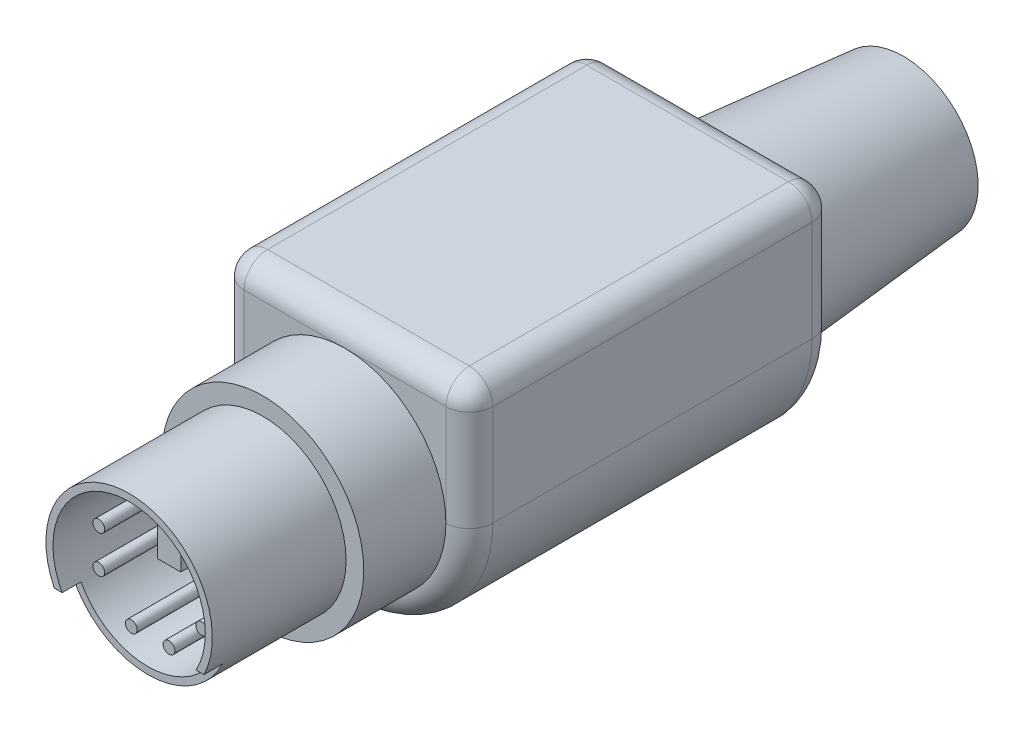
ISO-10303-21;
HEADER;
FILE_DESCRIPTION(('STEP AP214'),'2;1');
FILE_NAME('part.step','',(''),(''),'','','');
FILE_SCHEMA(('AUTOMOTIVE_DESIGN { 1 0 10303 214 1 1 1 1 }'));
ENDSEC;
DATA;
#1=APPLICATION_CONTEXT('core data for automotive mechanical design processes');
#2=APPLICATION_PROTOCOL_DEFINITION('international standard','automotive_design',2000,#1);
#3=PRODUCT_CONTEXT('',#1,'mechanical');
#4=PRODUCT('Part','Part','',(#3));
#5=PRODUCT_RELATED_PRODUCT_CATEGORY('part','',(#4));
#6=PRODUCT_DEFINITION_FORMATION('','',#4);
#7=PRODUCT_DEFINITION_CONTEXT('part definition',#1,'design');
#8=PRODUCT_DEFINITION('design','',#6,#7);
#9=PRODUCT_DEFINITION_SHAPE('','',#8);
#10=(LENGTH_UNIT() NAMED_UNIT(*) SI_UNIT(.MILLI.,.METRE.));
#11=(NAMED_UNIT(*) PLANE_ANGLE_UNIT() SI_UNIT($,.RADIAN.));
#12=(NAMED_UNIT(*) SI_UNIT($,.STERADIAN.) SOLID_ANGLE_UNIT());
#13=UNCERTAINTY_MEASURE_WITH_UNIT(LENGTH_MEASURE(1.E-05),#10,'distance_accuracy_value','');
#14=(GEOMETRIC_REPRESENTATION_CONTEXT(3) GLOBAL_UNCERTAINTY_ASSIGNED_CONTEXT((#13)) GLOBAL_UNIT_ASSIGNED_CONTEXT((#10,
#11,#12)) REPRESENTATION_CONTEXT('',''));
#15=CARTESIAN_POINT('',(0.,0.,0.));
#16=DIRECTION('',(0.,0.,1.));
#17=DIRECTION('',(1.,0.,0.));
#18=AXIS2_PLACEMENT_3D('',#15,#16,#17);
#19=CARTESIAN_POINT('',(0.,0.,0.));
#20=DIRECTION('',(0.,0.,1.));
#21=DIRECTION('',(1.,0.,0.));
#22=AXIS2_PLACEMENT_3D('',#19,#20,#21);
#23=PLANE('',#22);
#24=DIRECTION('',(0.,1.,0.));
#25=VECTOR('',#24,1.);
#26=CARTESIAN_POINT('',(-5.461,6.731,0.));
#27=LINE('',#26,#25);
#28=CARTESIAN_POINT('',(-5.461,0.,0.));
#29=VERTEX_POINT('',#28);
#30=CARTESIAN_POINT('',(-5.461,5.461,0.));
#31=VERTEX_POINT('',#30);
#32=EDGE_CURVE('E336',#29,#31,#27,.T.);
#33=ORIENTED_EDGE('',*,*,#32,.T.);
#34=DIRECTION('',(1.,0.,0.));
#35=VECTOR('',#34,1.);
#36=CARTESIAN_POINT('',(6.731,5.461,0.));
#37=LINE('',#36,#35);
#38=CARTESIAN_POINT('',(5.461,5.461,0.));
#39=VERTEX_POINT('',#38);
#40=EDGE_CURVE('E44',#31,#39,#37,.T.);
#41=ORIENTED_EDGE('',*,*,#40,.T.);
#42=DIRECTION('',(0.,1.,0.));
#43=VECTOR('',#42,1.);
#44=CARTESIAN_POINT('',(5.461,0.,0.));
#45=LINE('',#44,#43);
#46=CARTESIAN_POINT('',(5.461,0.,0.));
#47=VERTEX_POINT('',#46);
#48=EDGE_CURVE('E332',#39,#47,#45,.F.);
#49=ORIENTED_EDGE('',*,*,#48,.T.);
#50=CARTESIAN_POINT('',(0.,0.,0.));
#51=DIRECTION('',(0.,0.,1.));
#52=DIRECTION('',(1.,0.,0.));
#53=AXIS2_PLACEMENT_3D('',#50,#51,#52);
#54=CIRCLE('',#53,5.461);
#55=EDGE_CURVE('E334',#47,#29,#54,.F.);
#56=ORIENTED_EDGE('',*,*,#55,.T.);
#57=EDGE_LOOP('',(#33,#41,#49,#56));
#58=FACE_BOUND('',#57,.T.);
#59=CARTESIAN_POINT('',(0.,0.,0.));
#60=DIRECTION('',(0.,0.,1.));
#61=DIRECTION('',(1.,0.,0.));
#62=AXIS2_PLACEMENT_3D('',#59,#60,#61);
#63=CIRCLE('',#62,4.953);
#64=CARTESIAN_POINT('',(4.953,0.,0.));
#65=VERTEX_POINT('',#64);
#66=EDGE_CURVE('E11',#65,#65,#63,.F.);
#67=ORIENTED_EDGE('',*,*,#66,.F.);
#68=EDGE_LOOP('',(#67));
#69=FACE_BOUND('',#68,.T.);
#70=ADVANCED_FACE('F36',(#58,#69),#23,.F.);
#71=CARTESIAN_POINT('',(0.,0.,24.257));
#72=DIRECTION('',(0.,0.,1.));
#73=DIRECTION('',(1.,0.,0.));
#74=AXIS2_PLACEMENT_3D('',#71,#72,#73);
#75=PLANE('',#74);
#76=CARTESIAN_POINT('',(2.78348565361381,1.01310592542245,24.257));
#77=DIRECTION('',(0.,0.,1.));
#78=DIRECTION('',(1.,0.,0.));
#79=AXIS2_PLACEMENT_3D('',#76,#77,#78);
#80=CIRCLE('',#79,0.3175);
#81=CARTESIAN_POINT('',(3.10098565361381,1.01310592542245,24.257));
#82=VERTEX_POINT('',#81);
#83=EDGE_CURVE('E583',#82,#82,#80,.T.);
#84=ORIENTED_EDGE('',*,*,#83,.F.);
#85=EDGE_LOOP('',(#84));
#86=FACE_BOUND('',#85,.T.);
#87=CARTESIAN_POINT('',(-2.78348565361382,-1.01310592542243,24.257));
#88=DIRECTION('',(0.,0.,1.));
#89=DIRECTION('',(1.,0.,0.));
#90=AXIS2_PLACEMENT_3D('',#87,#88,#89);
#91=CIRCLE('',#90,0.3175);
#92=CARTESIAN_POINT('',(-2.46598565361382,-1.01310592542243,24.257));
#93=VERTEX_POINT('',#92);
#94=EDGE_CURVE('E595',#93,#93,#91,.T.);
#95=ORIENTED_EDGE('',*,*,#94,.F.);
#96=EDGE_LOOP('',(#95));
#97=FACE_BOUND('',#96,.T.);
#98=CARTESIAN_POINT('',(1.01310592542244,-2.78348565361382,24.257));
#99=DIRECTION('',(0.,0.,1.));
#100=DIRECTION('',(1.,0.,0.));
#101=AXIS2_PLACEMENT_3D('',#98,#99,#100);
#102=CIRCLE('',#101,0.3175);
#103=CARTESIAN_POINT('',(1.33060592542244,-2.78348565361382,24.257));
#104=VERTEX_POINT('',#103);
#105=EDGE_CURVE('E607',#104,#104,#102,.T.);
#106=ORIENTED_EDGE('',*,*,#105,.F.);
#107=EDGE_LOOP('',(#106));
#108=FACE_BOUND('',#107,.T.);
#109=CARTESIAN_POINT('',(0.,0.,24.257));
#110=DIRECTION('',(0.,0.,1.));
#111=DIRECTION('',(1.,0.,0.));
#112=AXIS2_PLACEMENT_3D('',#109,#110,#111);
#113=CIRCLE('',#112,4.12196942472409);
#114=CARTESIAN_POINT('',(4.12196942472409,0.,24.257));
#115=VERTEX_POINT('',#114);
#116=EDGE_CURVE('E274',#115,#115,#113,.F.);
#117=ORIENTED_EDGE('',*,*,#116,.F.);
#118=EDGE_LOOP('',(#117));
#119=FACE_BOUND('',#118,.T.);
#120=DIRECTION('',(-1.,0.,0.));
#121=VECTOR('',#120,1.);
#122=CARTESIAN_POINT('',(0.635,0.0579694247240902,24.257));
#123=LINE('',#122,#121);
#124=CARTESIAN_POINT('',(0.635,0.0579694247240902,24.257));
#125=VERTEX_POINT('',#124);
#126=CARTESIAN_POINT('',(-0.635,0.0579694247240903,24.257));
#127=VERTEX_POINT('',#126);
#128=EDGE_CURVE('E51',#125,#127,#123,.T.);
#129=ORIENTED_EDGE('',*,*,#128,.T.);
#130=DIRECTION('',(0.,-1.,0.));
#131=VECTOR('',#130,1.);
#132=CARTESIAN_POINT('',(-0.635,2.59796942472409,24.257));
#133=LINE('',#132,#131);
#134=CARTESIAN_POINT('',(-0.635,2.59796942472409,24.257));
#135=VERTEX_POINT('',#134);
#136=EDGE_CURVE('E161',#135,#127,#133,.T.);
#137=ORIENTED_EDGE('',*,*,#136,.F.);
#138=DIRECTION('',(1.,0.,0.));
#139=VECTOR('',#138,1.);
#140=CARTESIAN_POINT('',(-0.635,2.59796942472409,24.257));
#141=LINE('',#140,#139);
#142=CARTESIAN_POINT('',(0.635,2.59796942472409,24.257));
#143=VERTEX_POINT('',#142);
#144=EDGE_CURVE('E166',#135,#143,#141,.T.);
#145=ORIENTED_EDGE('',*,*,#144,.T.);
#146=DIRECTION('',(0.,1.,0.));
#147=VECTOR('',#146,1.);
#148=CARTESIAN_POINT('',(0.635,0.0579694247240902,24.257));
#149=LINE('',#148,#147);
#150=EDGE_CURVE('E56',#125,#143,#149,.T.);
#151=ORIENTED_EDGE('',*,*,#150,.F.);
#152=EDGE_LOOP('',(#129,#137,#145,#151));
#153=FACE_BOUND('',#152,.T.);
#154=CARTESIAN_POINT('',(-1.02631680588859,-2.81978224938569,24.257));
#155=DIRECTION('',(0.,0.,1.));
#156=DIRECTION('',(1.,0.,0.));
#157=AXIS2_PLACEMENT_3D('',#154,#155,#156);
#158=CIRCLE('',#157,0.3175);
#159=CARTESIAN_POINT('',(-0.708816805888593,-2.81978224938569,24.257));
#160=VERTEX_POINT('',#159);
#161=EDGE_CURVE('E601',#160,#160,#158,.T.);
#162=ORIENTED_EDGE('',*,*,#161,.F.);
#163=EDGE_LOOP('',(#162));
#164=FACE_BOUND('',#163,.T.);
#165=CARTESIAN_POINT('',(2.78348565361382,-1.01310592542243,24.257));
#166=DIRECTION('',(0.,0.,1.));
#167=DIRECTION('',(1.,0.,0.));
#168=AXIS2_PLACEMENT_3D('',#165,#166,#167);
#169=CIRCLE('',#168,0.3175);
#170=CARTESIAN_POINT('',(3.10098565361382,-1.01310592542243,24.257));
#171=VERTEX_POINT('',#170);
#172=EDGE_CURVE('E589',#171,#171,#169,.T.);
#173=ORIENTED_EDGE('',*,*,#172,.F.);
#174=EDGE_LOOP('',(#173));
#175=FACE_BOUND('',#174,.T.);
#176=CARTESIAN_POINT('',(-2.78348565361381,1.01310592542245,24.257));
#177=DIRECTION('',(0.,0.,1.));
#178=DIRECTION('',(1.,0.,0.));
#179=AXIS2_PLACEMENT_3D('',#176,#177,#178);
#180=CIRCLE('',#179,0.3175);
#181=CARTESIAN_POINT('',(-2.46598565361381,1.01310592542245,24.257));
#182=VERTEX_POINT('',#181);
#183=EDGE_CURVE('E575',#182,#182,#180,.T.);
#184=ORIENTED_EDGE('',*,*,#183,.F.);
#185=EDGE_LOOP('',(#184));
#186=FACE_BOUND('',#185,.T.);
#187=ADVANCED_FACE('F163',(#86,#97,#108,#119,#153,#164,#175,#186),#75,.T.);
#188=CARTESIAN_POINT('',(0.,0.,31.496));
#189=DIRECTION('',(0.,0.,-1.));
#190=DIRECTION('',(-1.,0.,0.));
#191=AXIS2_PLACEMENT_3D('',#188,#189,#190);
#192=CYLINDRICAL_SURFACE('',#191,4.50296942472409);
#193=CARTESIAN_POINT('',(0.,0.,24.257));
#194=DIRECTION('',(0.,0.,1.));
#195=DIRECTION('',(1.,0.,0.));
#196=AXIS2_PLACEMENT_3D('',#193,#194,#195);
#197=CIRCLE('',#196,4.50296942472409);
#198=CARTESIAN_POINT('',(4.50296942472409,0.,24.257));
#199=VERTEX_POINT('',#198);
#200=EDGE_CURVE('E277',#199,#199,#197,.T.);
#201=ORIENTED_EDGE('',*,*,#200,.T.);
#202=EDGE_LOOP('',(#201));
#203=FACE_BOUND('',#202,.T.);
#204=DIRECTION('',(0.,0.,1.));
#205=VECTOR('',#204,1.);
#206=CARTESIAN_POINT('',(-4.05258987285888,-1.96296942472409,30.48));
#207=LINE('',#206,#205);
#208=CARTESIAN_POINT('',(-4.05258987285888,-1.96296942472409,30.48));
#209=VERTEX_POINT('',#208);
#210=CARTESIAN_POINT('',(-4.05258987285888,-1.96296942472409,31.496));
#211=VERTEX_POINT('',#210);
#212=EDGE_CURVE('E217',#209,#211,#207,.T.);
#213=ORIENTED_EDGE('',*,*,#212,.T.);
#214=CARTESIAN_POINT('',(0.,0.,31.496));
#215=DIRECTION('',(0.,0.,1.));
#216=DIRECTION('',(1.,0.,0.));
#217=AXIS2_PLACEMENT_3D('',#214,#215,#216);
#218=CIRCLE('',#217,4.50296942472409);
#219=CARTESIAN_POINT('',(4.05258987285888,-1.96296942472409,31.496));
#220=VERTEX_POINT('',#219);
#221=EDGE_CURVE('E280',#220,#211,#218,.T.);
#222=ORIENTED_EDGE('',*,*,#221,.F.);
#223=DIRECTION('',(0.,0.,1.));
#224=VECTOR('',#223,1.);
#225=CARTESIAN_POINT('',(4.05258987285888,-1.96296942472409,30.48));
#226=LINE('',#225,#224);
#227=CARTESIAN_POINT('',(4.05258987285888,-1.96296942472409,30.48));
#228=VERTEX_POINT('',#227);
#229=EDGE_CURVE('E216',#228,#220,#226,.T.);
#230=ORIENTED_EDGE('',*,*,#229,.F.);
#231=CARTESIAN_POINT('',(0.,0.,30.48));
#232=DIRECTION('',(0.,0.,1.));
#233=DIRECTION('',(1.,0.,0.));
#234=AXIS2_PLACEMENT_3D('',#231,#232,#233);
#235=CIRCLE('',#234,4.50296942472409);
#236=EDGE_CURVE('E206',#209,#228,#235,.T.);
#237=ORIENTED_EDGE('',*,*,#236,.F.);
#238=EDGE_LOOP('',(#213,#222,#230,#237));
#239=FACE_BOUND('',#238,.T.);
#240=ADVANCED_FACE('F421',(#203,#239),#192,.T.);
#241=CARTESIAN_POINT('',(0.,0.,31.496));
#242=DIRECTION('',(0.,0.,1.));
#243=DIRECTION('',(1.,0.,0.));
#244=AXIS2_PLACEMENT_3D('',#241,#242,#243);
#245=PLANE('',#244);
#246=ORIENTED_EDGE('',*,*,#221,.T.);
#247=DIRECTION('',(1.,0.,0.));
#248=VECTOR('',#247,1.);
#249=CARTESIAN_POINT('',(-4.05258987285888,-1.96296942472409,31.496));
#250=LINE('',#249,#248);
#251=CARTESIAN_POINT('',(-3.62455279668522,-1.96296942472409,31.496));
#252=VERTEX_POINT('',#251);
#253=EDGE_CURVE('E203',#211,#252,#250,.T.);
#254=ORIENTED_EDGE('',*,*,#253,.T.);
#255=CARTESIAN_POINT('',(0.,0.,31.496));
#256=DIRECTION('',(0.,0.,1.));
#257=DIRECTION('',(1.,0.,0.));
#258=AXIS2_PLACEMENT_3D('',#255,#256,#257);
#259=CIRCLE('',#258,4.12196942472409);
#260=CARTESIAN_POINT('',(3.62455279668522,-1.96296942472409,31.496));
#261=VERTEX_POINT('',#260);
#262=EDGE_CURVE('E271',#261,#252,#259,.T.);
#263=ORIENTED_EDGE('',*,*,#262,.F.);
#264=DIRECTION('',(1.,0.,0.));
#265=VECTOR('',#264,1.);
#266=CARTESIAN_POINT('',(3.62455279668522,-1.96296942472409,31.496));
#267=LINE('',#266,#265);
#268=EDGE_CURVE('E200',#261,#220,#267,.T.);
#269=ORIENTED_EDGE('',*,*,#268,.T.);
#270=EDGE_LOOP('',(#246,#254,#263,#269));
#271=FACE_BOUND('',#270,.T.);
#272=ADVANCED_FACE('F461',(#271),#245,.T.);
#273=CARTESIAN_POINT('',(0.,0.,12.5983098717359));
#274=DIRECTION('',(0.,0.,1.));
#275=DIRECTION('',(1.,0.,0.));
#276=AXIS2_PLACEMENT_3D('',#273,#274,#275);
#277=CYLINDRICAL_SURFACE('',#276,4.12196942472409);
#278=ORIENTED_EDGE('',*,*,#116,.T.);
#279=EDGE_LOOP('',(#278));
#280=FACE_BOUND('',#279,.T.);
#281=DIRECTION('',(0.,0.,1.));
#282=VECTOR('',#281,1.);
#283=CARTESIAN_POINT('',(-3.62455279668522,-1.96296942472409,30.48));
#284=LINE('',#283,#282);
#285=CARTESIAN_POINT('',(-3.62455279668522,-1.96296942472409,30.48));
#286=VERTEX_POINT('',#285);
#287=EDGE_CURVE('E221',#286,#252,#284,.T.);
#288=ORIENTED_EDGE('',*,*,#287,.F.);
#289=CARTESIAN_POINT('',(0.,0.,30.48));
#290=DIRECTION('',(0.,0.,1.));
#291=DIRECTION('',(1.,0.,0.));
#292=AXIS2_PLACEMENT_3D('',#289,#290,#291);
#293=CIRCLE('',#292,4.12196942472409);
#294=CARTESIAN_POINT('',(3.62455279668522,-1.96296942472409,30.48));
#295=VERTEX_POINT('',#294);
#296=EDGE_CURVE('E211',#286,#295,#293,.T.);
#297=ORIENTED_EDGE('',*,*,#296,.T.);
#298=DIRECTION('',(0.,0.,1.));
#299=VECTOR('',#298,1.);
#300=CARTESIAN_POINT('',(3.62455279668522,-1.96296942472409,30.48));
#301=LINE('',#300,#299);
#302=EDGE_CURVE('E223',#295,#261,#301,.T.);
#303=ORIENTED_EDGE('',*,*,#302,.T.);
#304=ORIENTED_EDGE('',*,*,#262,.T.);
#305=EDGE_LOOP('',(#288,#297,#303,#304));
#306=FACE_BOUND('',#305,.T.);
#307=ADVANCED_FACE('F455',(#280,#306),#277,.F.);
#308=CARTESIAN_POINT('',(0.,0.,19.812));
#309=DIRECTION('',(0.,0.,1.));
#310=DIRECTION('',(1.,0.,0.));
#311=AXIS2_PLACEMENT_3D('',#308,#309,#310);
#312=PLANE('',#311);
#313=CARTESIAN_POINT('',(0.,0.,19.812));
#314=DIRECTION('',(0.,0.,1.));
#315=DIRECTION('',(1.,0.,0.));
#316=AXIS2_PLACEMENT_3D('',#313,#314,#315);
#317=CIRCLE('',#316,5.461);
#318=CARTESIAN_POINT('',(5.461,0.,19.812));
#319=VERTEX_POINT('',#318);
#320=CARTESIAN_POINT('',(0.,5.461,19.812));
#321=VERTEX_POINT('',#320);
#322=EDGE_CURVE('E284',#319,#321,#317,.T.);
#323=ORIENTED_EDGE('',*,*,#322,.F.);
#324=DIRECTION('',(0.,1.,0.));
#325=VECTOR('',#324,1.);
#326=CARTESIAN_POINT('',(5.461,6.731,19.812));
#327=LINE('',#326,#325);
#328=CARTESIAN_POINT('',(5.461,5.461,19.812));
#329=VERTEX_POINT('',#328);
#330=EDGE_CURVE('E313',#319,#329,#327,.T.);
#331=ORIENTED_EDGE('',*,*,#330,.T.);
#332=DIRECTION('',(1.,0.,0.));
#333=VECTOR('',#332,1.);
#334=CARTESIAN_POINT('',(0.,5.461,19.812));
#335=LINE('',#334,#333);
#336=EDGE_CURVE('E310',#329,#321,#335,.F.);
#337=ORIENTED_EDGE('',*,*,#336,.T.);
#338=EDGE_LOOP('',(#323,#331,#337));
#339=FACE_BOUND('',#338,.T.);
#340=ADVANCED_FACE('F433',(#339),#312,.T.);
#341=CARTESIAN_POINT('',(0.,0.,24.257));
#342=DIRECTION('',(0.,0.,1.));
#343=DIRECTION('',(1.,0.,0.));
#344=AXIS2_PLACEMENT_3D('',#341,#342,#343);
#345=PLANE('',#344);
#346=CARTESIAN_POINT('',(0.,0.,24.257));
#347=DIRECTION('',(0.,0.,1.));
#348=DIRECTION('',(1.,0.,0.));
#349=AXIS2_PLACEMENT_3D('',#346,#347,#348);
#350=CIRCLE('',#349,5.461);
#351=CARTESIAN_POINT('',(5.461,0.,24.257));
#352=VERTEX_POINT('',#351);
#353=EDGE_CURVE('E287',#352,#352,#350,.T.);
#354=ORIENTED_EDGE('',*,*,#353,.T.);
#355=EDGE_LOOP('',(#354));
#356=FACE_BOUND('',#355,.T.);
#357=ORIENTED_EDGE('',*,*,#200,.F.);
#358=EDGE_LOOP('',(#357));
#359=FACE_BOUND('',#358,.T.);
#360=ADVANCED_FACE('F431',(#356,#359),#345,.T.);
#361=CARTESIAN_POINT('',(-5.461,0.,19.812));
#362=VERTEX_POINT('',#361);
#363=EDGE_CURVE('E288',#321,#362,#317,.T.);
#364=ORIENTED_EDGE('',*,*,#363,.F.);
#365=DIRECTION('',(1.,0.,0.));
#366=VECTOR('',#365,1.);
#367=CARTESIAN_POINT('',(0.,5.461,19.812));
#368=LINE('',#367,#366);
#369=CARTESIAN_POINT('',(-5.461,5.461,19.812));
#370=VERTEX_POINT('',#369);
#371=EDGE_CURVE('E308',#321,#370,#368,.F.);
#372=ORIENTED_EDGE('',*,*,#371,.T.);
#373=DIRECTION('',(0.,1.,0.));
#374=VECTOR('',#373,1.);
#375=CARTESIAN_POINT('',(-5.461,0.,19.812));
#376=LINE('',#375,#374);
#377=EDGE_CURVE('E306',#370,#362,#376,.F.);
#378=ORIENTED_EDGE('',*,*,#377,.T.);
#379=EDGE_LOOP('',(#364,#372,#378));
#380=FACE_BOUND('',#379,.T.);
#381=ADVANCED_FACE('F428',(#380),#312,.T.);
#382=CARTESIAN_POINT('',(-6.731,6.731,19.812));
#383=DIRECTION('',(0.,1.,0.));
#384=DIRECTION('',(-1.,0.,0.));
#385=AXIS2_PLACEMENT_3D('',#382,#383,#384);
#386=PLANE('',#385);
#387=DIRECTION('',(0.,0.,-1.));
#388=VECTOR('',#387,1.);
#389=CARTESIAN_POINT('',(-5.461,6.731,19.812));
#390=LINE('',#389,#388);
#391=CARTESIAN_POINT('',(-5.461,6.731,1.27));
#392=VERTEX_POINT('',#391);
#393=CARTESIAN_POINT('',(-5.461,6.731,18.542));
#394=VERTEX_POINT('',#393);
#395=EDGE_CURVE('E299',#392,#394,#390,.F.);
#396=ORIENTED_EDGE('',*,*,#395,.T.);
#397=DIRECTION('',(1.,0.,0.));
#398=VECTOR('',#397,1.);
#399=CARTESIAN_POINT('',(-6.731,6.731,18.542));
#400=LINE('',#399,#398);
#401=CARTESIAN_POINT('',(5.461,6.731,18.542));
#402=VERTEX_POINT('',#401);
#403=EDGE_CURVE('E303',#394,#402,#400,.T.);
#404=ORIENTED_EDGE('',*,*,#403,.T.);
#405=DIRECTION('',(0.,0.,-1.));
#406=VECTOR('',#405,1.);
#407=CARTESIAN_POINT('',(5.461,6.731,0.));
#408=LINE('',#407,#406);
#409=CARTESIAN_POINT('',(5.461,6.731,1.27));
#410=VERTEX_POINT('',#409);
#411=EDGE_CURVE('E301',#402,#410,#408,.T.);
#412=ORIENTED_EDGE('',*,*,#411,.T.);
#413=DIRECTION('',(1.,0.,0.));
#414=VECTOR('',#413,1.);
#415=CARTESIAN_POINT('',(-6.731,6.731,1.27));
#416=LINE('',#415,#414);
#417=EDGE_CURVE('E295',#410,#392,#416,.F.);
#418=ORIENTED_EDGE('',*,*,#417,.T.);
#419=EDGE_LOOP('',(#396,#404,#412,#418));
#420=FACE_BOUND('',#419,.T.);
#421=ADVANCED_FACE('F38',(#420),#386,.T.);
#422=CARTESIAN_POINT('',(-6.731,0.,19.812));
#423=DIRECTION('',(-1.,0.,0.));
#424=DIRECTION('',(0.,0.,1.));
#425=AXIS2_PLACEMENT_3D('',#422,#423,#424);
#426=PLANE('',#425);
#427=DIRECTION('',(0.,0.,-1.));
#428=VECTOR('',#427,1.);
#429=CARTESIAN_POINT('',(-6.731,0.,19.812));
#430=LINE('',#429,#428);
#431=CARTESIAN_POINT('',(-6.731,0.,18.542));
#432=VERTEX_POINT('',#431);
#433=CARTESIAN_POINT('',(-6.731,0.,1.27));
#434=VERTEX_POINT('',#433);
#435=EDGE_CURVE('E292',#432,#434,#430,.T.);
#436=ORIENTED_EDGE('',*,*,#435,.F.);
#437=DIRECTION('',(0.,1.,0.));
#438=VECTOR('',#437,1.);
#439=CARTESIAN_POINT('',(-6.731,0.,18.542));
#440=LINE('',#439,#438);
#441=CARTESIAN_POINT('',(-6.731,5.461,18.542));
#442=VERTEX_POINT('',#441);
#443=EDGE_CURVE('E326',#432,#442,#440,.T.);
#444=ORIENTED_EDGE('',*,*,#443,.T.);
#445=DIRECTION('',(0.,0.,-1.));
#446=VECTOR('',#445,1.);
#447=CARTESIAN_POINT('',(-6.731,5.461,19.812));
#448=LINE('',#447,#446);
#449=CARTESIAN_POINT('',(-6.731,5.461,1.27));
#450=VERTEX_POINT('',#449);
#451=EDGE_CURVE('E324',#442,#450,#448,.T.);
#452=ORIENTED_EDGE('',*,*,#451,.T.);
#453=DIRECTION('',(0.,1.,0.));
#454=VECTOR('',#453,1.);
#455=CARTESIAN_POINT('',(-6.731,0.,1.27));
#456=LINE('',#455,#454);
#457=EDGE_CURVE('E322',#450,#434,#456,.F.);
#458=ORIENTED_EDGE('',*,*,#457,.T.);
#459=EDGE_LOOP('',(#436,#444,#452,#458));
#460=FACE_BOUND('',#459,.T.);
#461=ADVANCED_FACE('F395',(#460),#426,.T.);
#462=CARTESIAN_POINT('',(0.,0.,19.812));
#463=DIRECTION('',(0.,0.,-1.));
#464=DIRECTION('',(-1.,0.,0.));
#465=AXIS2_PLACEMENT_3D('',#462,#463,#464);
#466=CYLINDRICAL_SURFACE('',#465,6.731);
#467=DIRECTION('',(0.,0.,-1.));
#468=VECTOR('',#467,1.);
#469=CARTESIAN_POINT('',(6.731,0.,19.812));
#470=LINE('',#469,#468);
#471=CARTESIAN_POINT('',(6.731,0.,18.542));
#472=VERTEX_POINT('',#471);
#473=CARTESIAN_POINT('',(6.731,0.,1.27));
#474=VERTEX_POINT('',#473);
#475=EDGE_CURVE('E291',#472,#474,#470,.T.);
#476=ORIENTED_EDGE('',*,*,#475,.F.);
#477=CARTESIAN_POINT('',(0.,0.,18.542));
#478=DIRECTION('',(0.,0.,1.));
#479=DIRECTION('',(1.,0.,0.));
#480=AXIS2_PLACEMENT_3D('',#477,#478,#479);
#481=CIRCLE('',#480,6.731);
#482=EDGE_CURVE('E330',#472,#432,#481,.F.);
#483=ORIENTED_EDGE('',*,*,#482,.T.);
#484=ORIENTED_EDGE('',*,*,#435,.T.);
#485=CARTESIAN_POINT('',(0.,0.,1.27));
#486=DIRECTION('',(0.,0.,1.));
#487=DIRECTION('',(1.,0.,0.));
#488=AXIS2_PLACEMENT_3D('',#485,#486,#487);
#489=CIRCLE('',#488,6.731);
#490=EDGE_CURVE('E328',#434,#474,#489,.T.);
#491=ORIENTED_EDGE('',*,*,#490,.T.);
#492=EDGE_LOOP('',(#476,#483,#484,#491));
#493=FACE_BOUND('',#492,.T.);
#494=ADVANCED_FACE('F392',(#493),#466,.T.);
#495=CARTESIAN_POINT('',(6.731,0.,19.812));
#496=DIRECTION('',(-1.,0.,0.));
#497=DIRECTION('',(0.,-1.,0.));
#498=AXIS2_PLACEMENT_3D('',#495,#496,#497);
#499=PLANE('',#498);
#500=DIRECTION('',(0.,0.,-1.));
#501=VECTOR('',#500,1.);
#502=CARTESIAN_POINT('',(6.731,5.461,19.812));
#503=LINE('',#502,#501);
#504=CARTESIAN_POINT('',(6.731,5.461,1.27));
#505=VERTEX_POINT('',#504);
#506=CARTESIAN_POINT('',(6.731,5.461,18.542));
#507=VERTEX_POINT('',#506);
#508=EDGE_CURVE('E317',#505,#507,#503,.F.);
#509=ORIENTED_EDGE('',*,*,#508,.T.);
#510=DIRECTION('',(0.,1.,0.));
#511=VECTOR('',#510,1.);
#512=CARTESIAN_POINT('',(6.731,0.,18.542));
#513=LINE('',#512,#511);
#514=EDGE_CURVE('E319',#507,#472,#513,.F.);
#515=ORIENTED_EDGE('',*,*,#514,.T.);
#516=ORIENTED_EDGE('',*,*,#475,.T.);
#517=DIRECTION('',(0.,1.,0.));
#518=VECTOR('',#517,1.);
#519=CARTESIAN_POINT('',(6.731,0.,1.27));
#520=LINE('',#519,#518);
#521=EDGE_CURVE('E315',#474,#505,#520,.T.);
#522=ORIENTED_EDGE('',*,*,#521,.T.);
#523=EDGE_LOOP('',(#509,#515,#516,#522));
#524=FACE_BOUND('',#523,.T.);
#525=ADVANCED_FACE('F375',(#524),#499,.F.);
#526=CARTESIAN_POINT('',(0.,0.,24.257));
#527=DIRECTION('',(0.,0.,-1.));
#528=DIRECTION('',(-1.,0.,0.));
#529=AXIS2_PLACEMENT_3D('',#526,#527,#528);
#530=CYLINDRICAL_SURFACE('',#529,5.461);
#531=ORIENTED_EDGE('',*,*,#353,.F.);
#532=EDGE_LOOP('',(#531));
#533=FACE_BOUND('',#532,.T.);
#534=ORIENTED_EDGE('',*,*,#322,.T.);
#535=ORIENTED_EDGE('',*,*,#363,.T.);
#536=EDGE_CURVE('E283',#362,#319,#317,.T.);
#537=ORIENTED_EDGE('',*,*,#536,.T.);
#538=EDGE_LOOP('',(#534,#535,#537));
#539=FACE_BOUND('',#538,.T.);
#540=ADVANCED_FACE('F426',(#533,#539),#530,.T.);
#541=CARTESIAN_POINT('',(0.,0.,1.27));
#542=DIRECTION('',(0.,0.,1.));
#543=DIRECTION('',(1.,0.,0.));
#544=AXIS2_PLACEMENT_3D('',#541,#542,#543);
#545=TOROIDAL_SURFACE('',#544,5.461,1.27);
#546=CARTESIAN_POINT('',(5.461,0.,1.27));
#547=DIRECTION('',(0.,1.,0.));
#548=DIRECTION('',(0.,0.,1.));
#549=AXIS2_PLACEMENT_3D('',#546,#547,#548);
#550=CIRCLE('',#549,1.27);
#551=EDGE_CURVE('E265',#474,#47,#550,.T.);
#552=ORIENTED_EDGE('',*,*,#551,.F.);
#553=ORIENTED_EDGE('',*,*,#490,.F.);
#554=CARTESIAN_POINT('',(-5.461,0.,1.27));
#555=DIRECTION('',(0.,1.,0.));
#556=DIRECTION('',(0.,0.,1.));
#557=AXIS2_PLACEMENT_3D('',#554,#555,#556);
#558=CIRCLE('',#557,1.27);
#559=EDGE_CURVE('E268',#29,#434,#558,.T.);
#560=ORIENTED_EDGE('',*,*,#559,.F.);
#561=ORIENTED_EDGE('',*,*,#55,.F.);
#562=EDGE_LOOP('',(#552,#553,#560,#561));
#563=FACE_BOUND('',#562,.T.);
#564=ADVANCED_FACE('F441',(#563),#545,.T.);
#565=CARTESIAN_POINT('',(-5.461,0.,1.27));
#566=DIRECTION('',(0.,-1.,0.));
#567=DIRECTION('',(0.,0.,-1.));
#568=AXIS2_PLACEMENT_3D('',#565,#566,#567);
#569=CYLINDRICAL_SURFACE('',#568,1.27);
#570=ORIENTED_EDGE('',*,*,#559,.T.);
#571=ORIENTED_EDGE('',*,*,#457,.F.);
#572=CARTESIAN_POINT('',(-5.461,5.461,1.27));
#573=DIRECTION('',(0.,1.,0.));
#574=DIRECTION('',(0.,0.,1.));
#575=AXIS2_PLACEMENT_3D('',#572,#573,#574);
#576=CIRCLE('',#575,1.27);
#577=EDGE_CURVE('E262',#31,#450,#576,.T.);
#578=ORIENTED_EDGE('',*,*,#577,.F.);
#579=ORIENTED_EDGE('',*,*,#32,.F.);
#580=EDGE_LOOP('',(#570,#571,#578,#579));
#581=FACE_BOUND('',#580,.T.);
#582=ADVANCED_FACE('F353',(#581),#569,.T.);
#583=CARTESIAN_POINT('',(0.,5.461,1.27));
#584=DIRECTION('',(-1.,0.,0.));
#585=DIRECTION('',(0.,-1.,0.));
#586=AXIS2_PLACEMENT_3D('',#583,#584,#585);
#587=CYLINDRICAL_SURFACE('',#586,1.27);
#588=CARTESIAN_POINT('',(5.461,5.461,1.27));
#589=DIRECTION('',(1.,0.,0.));
#590=DIRECTION('',(0.,0.,-1.));
#591=AXIS2_PLACEMENT_3D('',#588,#589,#590);
#592=CIRCLE('',#591,1.27);
#593=EDGE_CURVE('E256',#39,#410,#592,.T.);
#594=ORIENTED_EDGE('',*,*,#593,.F.);
#595=ORIENTED_EDGE('',*,*,#40,.F.);
#596=CARTESIAN_POINT('',(-5.461,5.461,1.27));
#597=DIRECTION('',(-1.,0.,0.));
#598=DIRECTION('',(0.,0.,1.));
#599=AXIS2_PLACEMENT_3D('',#596,#597,#598);
#600=CIRCLE('',#599,1.27);
#601=EDGE_CURVE('E259',#392,#31,#600,.T.);
#602=ORIENTED_EDGE('',*,*,#601,.F.);
#603=ORIENTED_EDGE('',*,*,#417,.F.);
#604=EDGE_LOOP('',(#594,#595,#602,#603));
#605=FACE_BOUND('',#604,.T.);
#606=ADVANCED_FACE('F348',(#605),#587,.T.);
#607=CARTESIAN_POINT('',(5.461,0.,1.27));
#608=DIRECTION('',(0.,1.,0.));
#609=DIRECTION('',(-1.,0.,0.));
#610=AXIS2_PLACEMENT_3D('',#607,#608,#609);
#611=CYLINDRICAL_SURFACE('',#610,1.27);
#612=ORIENTED_EDGE('',*,*,#551,.T.);
#613=ORIENTED_EDGE('',*,*,#48,.F.);
#614=CARTESIAN_POINT('',(5.461,5.461,1.27));
#615=DIRECTION('',(0.,1.,0.));
#616=DIRECTION('',(0.,0.,1.));
#617=AXIS2_PLACEMENT_3D('',#614,#615,#616);
#618=CIRCLE('',#617,1.27);
#619=EDGE_CURVE('E254',#505,#39,#618,.T.);
#620=ORIENTED_EDGE('',*,*,#619,.F.);
#621=ORIENTED_EDGE('',*,*,#521,.F.);
#622=EDGE_LOOP('',(#612,#613,#620,#621));
#623=FACE_BOUND('',#622,.T.);
#624=ADVANCED_FACE('F739',(#623),#611,.T.);
#625=CARTESIAN_POINT('',(-5.461,5.461,1.27));
#626=DIRECTION('',(0.,0.,1.));
#627=DIRECTION('',(1.,0.,0.));
#628=AXIS2_PLACEMENT_3D('',#625,#626,#627);
#629=SPHERICAL_SURFACE('',#628,1.27);
#630=ORIENTED_EDGE('',*,*,#601,.T.);
#631=ORIENTED_EDGE('',*,*,#577,.T.);
#632=CARTESIAN_POINT('',(-5.461,5.461,1.27));
#633=DIRECTION('',(0.,0.,-1.));
#634=DIRECTION('',(-1.,0.,0.));
#635=AXIS2_PLACEMENT_3D('',#632,#633,#634);
#636=CIRCLE('',#635,1.27);
#637=EDGE_CURVE('E248',#392,#450,#636,.F.);
#638=ORIENTED_EDGE('',*,*,#637,.F.);
#639=EDGE_LOOP('',(#630,#631,#638));
#640=FACE_BOUND('',#639,.T.);
#641=ADVANCED_FACE('F355',(#640),#629,.T.);
#642=CARTESIAN_POINT('',(5.461,5.461,1.27));
#643=DIRECTION('',(0.,0.,1.));
#644=DIRECTION('',(1.,0.,0.));
#645=AXIS2_PLACEMENT_3D('',#642,#643,#644);
#646=SPHERICAL_SURFACE('',#645,1.27);
#647=ORIENTED_EDGE('',*,*,#619,.T.);
#648=ORIENTED_EDGE('',*,*,#593,.T.);
#649=CARTESIAN_POINT('',(5.461,5.461,1.27));
#650=DIRECTION('',(0.,0.,-1.));
#651=DIRECTION('',(-1.,0.,0.));
#652=AXIS2_PLACEMENT_3D('',#649,#650,#651);
#653=CIRCLE('',#652,1.27);
#654=EDGE_CURVE('E245',#505,#410,#653,.F.);
#655=ORIENTED_EDGE('',*,*,#654,.F.);
#656=EDGE_LOOP('',(#647,#648,#655));
#657=FACE_BOUND('',#656,.T.);
#658=ADVANCED_FACE('F367',(#657),#646,.T.);
#659=CARTESIAN_POINT('',(0.,0.,18.542));
#660=DIRECTION('',(0.,0.,1.));
#661=DIRECTION('',(1.,0.,0.));
#662=AXIS2_PLACEMENT_3D('',#659,#660,#661);
#663=TOROIDAL_SURFACE('',#662,5.461,1.27);
#664=CARTESIAN_POINT('',(5.461,0.,18.542));
#665=DIRECTION('',(0.,1.,0.));
#666=DIRECTION('',(-1.,0.,0.));
#667=AXIS2_PLACEMENT_3D('',#664,#665,#666);
#668=CIRCLE('',#667,1.27);
#669=EDGE_CURVE('E243',#319,#472,#668,.T.);
#670=ORIENTED_EDGE('',*,*,#669,.F.);
#671=ORIENTED_EDGE('',*,*,#536,.F.);
#672=CARTESIAN_POINT('',(-5.461,0.,18.542));
#673=DIRECTION('',(0.,1.,0.));
#674=DIRECTION('',(0.,0.,1.));
#675=AXIS2_PLACEMENT_3D('',#672,#673,#674);
#676=CIRCLE('',#675,1.27);
#677=EDGE_CURVE('E251',#432,#362,#676,.T.);
#678=ORIENTED_EDGE('',*,*,#677,.F.);
#679=ORIENTED_EDGE('',*,*,#482,.F.);
#680=EDGE_LOOP('',(#670,#671,#678,#679));
#681=FACE_BOUND('',#680,.T.);
#682=ADVANCED_FACE('F388',(#681),#663,.T.);
#683=CARTESIAN_POINT('',(-5.461,0.,18.542));
#684=DIRECTION('',(0.,1.,0.));
#685=DIRECTION('',(0.,0.,1.));
#686=AXIS2_PLACEMENT_3D('',#683,#684,#685);
#687=CYLINDRICAL_SURFACE('',#686,1.27);
#688=ORIENTED_EDGE('',*,*,#677,.T.);
#689=ORIENTED_EDGE('',*,*,#377,.F.);
#690=CARTESIAN_POINT('',(-5.461,5.461,18.542));
#691=DIRECTION('',(0.,1.,0.));
#692=DIRECTION('',(0.,0.,1.));
#693=AXIS2_PLACEMENT_3D('',#690,#691,#692);
#694=CIRCLE('',#693,1.27);
#695=EDGE_CURVE('E240',#442,#370,#694,.T.);
#696=ORIENTED_EDGE('',*,*,#695,.F.);
#697=ORIENTED_EDGE('',*,*,#443,.F.);
#698=EDGE_LOOP('',(#688,#689,#696,#697));
#699=FACE_BOUND('',#698,.T.);
#700=ADVANCED_FACE('F399',(#699),#687,.T.);
#701=CARTESIAN_POINT('',(-5.461,5.461,19.812));
#702=DIRECTION('',(0.,0.,-1.));
#703=DIRECTION('',(-1.,0.,0.));
#704=AXIS2_PLACEMENT_3D('',#701,#702,#703);
#705=CYLINDRICAL_SURFACE('',#704,1.27);
#706=ORIENTED_EDGE('',*,*,#637,.T.);
#707=ORIENTED_EDGE('',*,*,#451,.F.);
#708=CARTESIAN_POINT('',(-5.461,5.461,18.542));
#709=DIRECTION('',(0.,0.,1.));
#710=DIRECTION('',(1.,0.,0.));
#711=AXIS2_PLACEMENT_3D('',#708,#709,#710);
#712=CIRCLE('',#711,1.27);
#713=EDGE_CURVE('E237',#394,#442,#712,.T.);
#714=ORIENTED_EDGE('',*,*,#713,.F.);
#715=ORIENTED_EDGE('',*,*,#395,.F.);
#716=EDGE_LOOP('',(#706,#707,#714,#715));
#717=FACE_BOUND('',#716,.T.);
#718=ADVANCED_FACE('F360',(#717),#705,.T.);
#719=CARTESIAN_POINT('',(5.461,5.461,19.812));
#720=DIRECTION('',(0.,0.,1.));
#721=DIRECTION('',(1.,0.,0.));
#722=AXIS2_PLACEMENT_3D('',#719,#720,#721);
#723=CYLINDRICAL_SURFACE('',#722,1.27);
#724=ORIENTED_EDGE('',*,*,#654,.T.);
#725=ORIENTED_EDGE('',*,*,#411,.F.);
#726=CARTESIAN_POINT('',(5.461,5.461,18.542));
#727=DIRECTION('',(0.,0.,1.));
#728=DIRECTION('',(1.,0.,0.));
#729=AXIS2_PLACEMENT_3D('',#726,#727,#728);
#730=CIRCLE('',#729,1.27);
#731=EDGE_CURVE('E234',#507,#402,#730,.T.);
#732=ORIENTED_EDGE('',*,*,#731,.F.);
#733=ORIENTED_EDGE('',*,*,#508,.F.);
#734=EDGE_LOOP('',(#724,#725,#732,#733));
#735=FACE_BOUND('',#734,.T.);
#736=ADVANCED_FACE('F371',(#735),#723,.T.);
#737=CARTESIAN_POINT('',(5.461,0.,18.542));
#738=DIRECTION('',(0.,-1.,0.));
#739=DIRECTION('',(1.,0.,0.));
#740=AXIS2_PLACEMENT_3D('',#737,#738,#739);
#741=CYLINDRICAL_SURFACE('',#740,1.27);
#742=ORIENTED_EDGE('',*,*,#669,.T.);
#743=ORIENTED_EDGE('',*,*,#514,.F.);
#744=CARTESIAN_POINT('',(5.461,5.461,18.542));
#745=DIRECTION('',(0.,1.,0.));
#746=DIRECTION('',(0.,0.,1.));
#747=AXIS2_PLACEMENT_3D('',#744,#745,#746);
#748=CIRCLE('',#747,1.27);
#749=EDGE_CURVE('E231',#329,#507,#748,.T.);
#750=ORIENTED_EDGE('',*,*,#749,.F.);
#751=ORIENTED_EDGE('',*,*,#330,.F.);
#752=EDGE_LOOP('',(#742,#743,#750,#751));
#753=FACE_BOUND('',#752,.T.);
#754=ADVANCED_FACE('F380',(#753),#741,.T.);
#755=CARTESIAN_POINT('',(-5.461,5.461,18.542));
#756=DIRECTION('',(0.,0.,1.));
#757=DIRECTION('',(1.,0.,0.));
#758=AXIS2_PLACEMENT_3D('',#755,#756,#757);
#759=SPHERICAL_SURFACE('',#758,1.27);
#760=ORIENTED_EDGE('',*,*,#713,.T.);
#761=ORIENTED_EDGE('',*,*,#695,.T.);
#762=CARTESIAN_POINT('',(-5.461,5.461,18.542));
#763=DIRECTION('',(-1.,0.,0.));
#764=DIRECTION('',(0.,0.,1.));
#765=AXIS2_PLACEMENT_3D('',#762,#763,#764);
#766=CIRCLE('',#765,1.27);
#767=EDGE_CURVE('E228',#394,#370,#766,.F.);
#768=ORIENTED_EDGE('',*,*,#767,.F.);
#769=EDGE_LOOP('',(#760,#761,#768));
#770=FACE_BOUND('',#769,.T.);
#771=ADVANCED_FACE('F401',(#770),#759,.T.);
#772=CARTESIAN_POINT('',(5.461,5.461,18.542));
#773=DIRECTION('',(0.,0.,1.));
#774=DIRECTION('',(1.,0.,0.));
#775=AXIS2_PLACEMENT_3D('',#772,#773,#774);
#776=SPHERICAL_SURFACE('',#775,1.27);
#777=ORIENTED_EDGE('',*,*,#749,.T.);
#778=ORIENTED_EDGE('',*,*,#731,.T.);
#779=CARTESIAN_POINT('',(5.461,5.461,18.542));
#780=DIRECTION('',(1.,0.,0.));
#781=DIRECTION('',(0.,0.,-1.));
#782=AXIS2_PLACEMENT_3D('',#779,#780,#781);
#783=CIRCLE('',#782,1.27);
#784=EDGE_CURVE('E220',#329,#402,#783,.F.);
#785=ORIENTED_EDGE('',*,*,#784,.F.);
#786=EDGE_LOOP('',(#777,#778,#785));
#787=FACE_BOUND('',#786,.T.);
#788=ADVANCED_FACE('F406',(#787),#776,.T.);
#789=CARTESIAN_POINT('',(-6.731,5.461,18.542));
#790=DIRECTION('',(1.,0.,0.));
#791=DIRECTION('',(0.,1.,0.));
#792=AXIS2_PLACEMENT_3D('',#789,#790,#791);
#793=CYLINDRICAL_SURFACE('',#792,1.27);
#794=ORIENTED_EDGE('',*,*,#371,.F.);
#795=ORIENTED_EDGE('',*,*,#336,.F.);
#796=ORIENTED_EDGE('',*,*,#784,.T.);
#797=ORIENTED_EDGE('',*,*,#403,.F.);
#798=ORIENTED_EDGE('',*,*,#767,.T.);
#799=EDGE_LOOP('',(#794,#795,#796,#797,#798));
#800=FACE_BOUND('',#799,.T.);
#801=ADVANCED_FACE('F403',(#800),#793,.T.);
#802=CARTESIAN_POINT('',(-4.05258987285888,-1.96296942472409,30.48));
#803=DIRECTION('',(0.,-1.,0.));
#804=DIRECTION('',(0.,0.,-1.));
#805=AXIS2_PLACEMENT_3D('',#802,#803,#804);
#806=PLANE('',#805);
#807=ORIENTED_EDGE('',*,*,#253,.F.);
#808=ORIENTED_EDGE('',*,*,#212,.F.);
#809=DIRECTION('',(1.,0.,0.));
#810=VECTOR('',#809,1.);
#811=CARTESIAN_POINT('',(-4.05258987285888,-1.96296942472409,30.48));
#812=LINE('',#811,#810);
#813=EDGE_CURVE('E214',#209,#286,#812,.T.);
#814=ORIENTED_EDGE('',*,*,#813,.T.);
#815=ORIENTED_EDGE('',*,*,#287,.T.);
#816=EDGE_LOOP('',(#807,#808,#814,#815));
#817=FACE_BOUND('',#816,.T.);
#818=ADVANCED_FACE('F413',(#817),#806,.T.);
#819=CARTESIAN_POINT('',(3.62455279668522,-1.96296942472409,30.48));
#820=DIRECTION('',(0.,-1.,0.));
#821=DIRECTION('',(0.,0.,-1.));
#822=AXIS2_PLACEMENT_3D('',#819,#820,#821);
#823=PLANE('',#822);
#824=ORIENTED_EDGE('',*,*,#268,.F.);
#825=ORIENTED_EDGE('',*,*,#302,.F.);
#826=DIRECTION('',(1.,0.,0.));
#827=VECTOR('',#826,1.);
#828=CARTESIAN_POINT('',(3.62455279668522,-1.96296942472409,30.48));
#829=LINE('',#828,#827);
#830=EDGE_CURVE('E209',#295,#228,#829,.T.);
#831=ORIENTED_EDGE('',*,*,#830,.T.);
#832=ORIENTED_EDGE('',*,*,#229,.T.);
#833=EDGE_LOOP('',(#824,#825,#831,#832));
#834=FACE_BOUND('',#833,.T.);
#835=ADVANCED_FACE('F485',(#834),#823,.T.);
#836=CARTESIAN_POINT('',(0.,0.,30.48));
#837=DIRECTION('',(0.,0.,1.));
#838=DIRECTION('',(1.,0.,0.));
#839=AXIS2_PLACEMENT_3D('',#836,#837,#838);
#840=PLANE('',#839);
#841=ORIENTED_EDGE('',*,*,#236,.T.);
#842=ORIENTED_EDGE('',*,*,#830,.F.);
#843=ORIENTED_EDGE('',*,*,#296,.F.);
#844=ORIENTED_EDGE('',*,*,#813,.F.);
#845=EDGE_LOOP('',(#841,#842,#843,#844));
#846=FACE_BOUND('',#845,.T.);
#847=ADVANCED_FACE('F489',(#846),#840,.T.);
#848=CARTESIAN_POINT('',(-0.635,2.59796942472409,29.337));
#849=DIRECTION('',(1.,0.,0.));
#850=DIRECTION('',(0.,1.,0.));
#851=AXIS2_PLACEMENT_3D('',#848,#849,#850);
#852=PLANE('',#851);
#853=ORIENTED_EDGE('',*,*,#136,.T.);
#854=DIRECTION('',(0.,0.,-1.));
#855=VECTOR('',#854,1.);
#856=CARTESIAN_POINT('',(-0.635,0.0579694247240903,29.337));
#857=LINE('',#856,#855);
#858=CARTESIAN_POINT('',(-0.635,0.0579694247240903,29.337));
#859=VERTEX_POINT('',#858);
#860=EDGE_CURVE('E198',#859,#127,#857,.T.);
#861=ORIENTED_EDGE('',*,*,#860,.F.);
#862=DIRECTION('',(0.,-1.,0.));
#863=VECTOR('',#862,1.);
#864=CARTESIAN_POINT('',(-0.635,2.59796942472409,29.337));
#865=LINE('',#864,#863);
#866=CARTESIAN_POINT('',(-0.635,2.59796942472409,29.337));
#867=VERTEX_POINT('',#866);
#868=EDGE_CURVE('E175',#867,#859,#865,.T.);
#869=ORIENTED_EDGE('',*,*,#868,.F.);
#870=DIRECTION('',(0.,0.,-1.));
#871=VECTOR('',#870,1.);
#872=CARTESIAN_POINT('',(-0.635,2.59796942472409,29.337));
#873=LINE('',#872,#871);
#874=EDGE_CURVE('E173',#867,#135,#873,.T.);
#875=ORIENTED_EDGE('',*,*,#874,.T.);
#876=EDGE_LOOP('',(#853,#861,#869,#875));
#877=FACE_BOUND('',#876,.T.);
#878=ADVANCED_FACE('F174',(#877),#852,.F.);
#879=CARTESIAN_POINT('',(0.635,0.0579694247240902,29.337));
#880=DIRECTION('',(0.,-1.,0.));
#881=DIRECTION('',(1.,0.,0.));
#882=AXIS2_PLACEMENT_3D('',#879,#880,#881);
#883=PLANE('',#882);
#884=ORIENTED_EDGE('',*,*,#128,.F.);
#885=DIRECTION('',(0.,0.,-1.));
#886=VECTOR('',#885,1.);
#887=CARTESIAN_POINT('',(0.635,0.0579694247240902,29.337));
#888=LINE('',#887,#886);
#889=CARTESIAN_POINT('',(0.635,0.0579694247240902,29.337));
#890=VERTEX_POINT('',#889);
#891=EDGE_CURVE('E196',#890,#125,#888,.T.);
#892=ORIENTED_EDGE('',*,*,#891,.F.);
#893=DIRECTION('',(-1.,0.,0.));
#894=VECTOR('',#893,1.);
#895=CARTESIAN_POINT('',(0.635,0.0579694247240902,29.337));
#896=LINE('',#895,#894);
#897=EDGE_CURVE('E185',#890,#859,#896,.T.);
#898=ORIENTED_EDGE('',*,*,#897,.T.);
#899=ORIENTED_EDGE('',*,*,#860,.T.);
#900=EDGE_LOOP('',(#884,#892,#898,#899));
#901=FACE_BOUND('',#900,.T.);
#902=ADVANCED_FACE('F501',(#901),#883,.T.);
#903=CARTESIAN_POINT('',(0.635,0.0579694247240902,29.337));
#904=DIRECTION('',(-1.,0.,0.));
#905=DIRECTION('',(0.,-1.,0.));
#906=AXIS2_PLACEMENT_3D('',#903,#904,#905);
#907=PLANE('',#906);
#908=ORIENTED_EDGE('',*,*,#150,.T.);
#909=DIRECTION('',(0.,0.,-1.));
#910=VECTOR('',#909,1.);
#911=CARTESIAN_POINT('',(0.635,2.59796942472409,29.337));
#912=LINE('',#911,#910);
#913=CARTESIAN_POINT('',(0.635,2.59796942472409,29.337));
#914=VERTEX_POINT('',#913);
#915=EDGE_CURVE('E179',#914,#143,#912,.T.);
#916=ORIENTED_EDGE('',*,*,#915,.F.);
#917=DIRECTION('',(0.,1.,0.));
#918=VECTOR('',#917,1.);
#919=CARTESIAN_POINT('',(0.635,0.0579694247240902,29.337));
#920=LINE('',#919,#918);
#921=EDGE_CURVE('E192',#890,#914,#920,.T.);
#922=ORIENTED_EDGE('',*,*,#921,.F.);
#923=ORIENTED_EDGE('',*,*,#891,.T.);
#924=EDGE_LOOP('',(#908,#916,#922,#923));
#925=FACE_BOUND('',#924,.T.);
#926=ADVANCED_FACE('F504',(#925),#907,.F.);
#927=CARTESIAN_POINT('',(-0.635,2.59796942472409,29.337));
#928=DIRECTION('',(0.,1.,0.));
#929=DIRECTION('',(0.,0.,1.));
#930=AXIS2_PLACEMENT_3D('',#927,#928,#929);
#931=PLANE('',#930);
#932=ORIENTED_EDGE('',*,*,#144,.F.);
#933=ORIENTED_EDGE('',*,*,#874,.F.);
#934=DIRECTION('',(1.,0.,0.));
#935=VECTOR('',#934,1.);
#936=CARTESIAN_POINT('',(-0.635,2.59796942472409,29.337));
#937=LINE('',#936,#935);
#938=EDGE_CURVE('E180',#867,#914,#937,.T.);
#939=ORIENTED_EDGE('',*,*,#938,.T.);
#940=ORIENTED_EDGE('',*,*,#915,.T.);
#941=EDGE_LOOP('',(#932,#933,#939,#940));
#942=FACE_BOUND('',#941,.T.);
#943=ADVANCED_FACE('F182',(#942),#931,.T.);
#944=CARTESIAN_POINT('',(-0.635,0.0579694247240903,29.337));
#945=DIRECTION('',(0.,0.,-1.));
#946=DIRECTION('',(-1.,0.,0.));
#947=AXIS2_PLACEMENT_3D('',#944,#945,#946);
#948=PLANE('',#947);
#949=ORIENTED_EDGE('',*,*,#868,.T.);
#950=ORIENTED_EDGE('',*,*,#897,.F.);
#951=ORIENTED_EDGE('',*,*,#921,.T.);
#952=ORIENTED_EDGE('',*,*,#938,.F.);
#953=EDGE_LOOP('',(#949,#950,#951,#952));
#954=FACE_BOUND('',#953,.T.);
#955=ADVANCED_FACE('F511',(#954),#948,.F.);
#956=CARTESIAN_POINT('',(1.01310592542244,-2.78348565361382,30.353));
#957=DIRECTION('',(0.,0.,-1.));
#958=DIRECTION('',(-1.,0.,0.));
#959=AXIS2_PLACEMENT_3D('',#956,#957,#958);
#960=CYLINDRICAL_SURFACE('',#959,0.3175);
#961=CARTESIAN_POINT('',(1.01310592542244,-2.78348565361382,30.353));
#962=DIRECTION('',(0.,0.,1.));
#963=DIRECTION('',(1.,0.,0.));
#964=AXIS2_PLACEMENT_3D('',#961,#962,#963);
#965=CIRCLE('',#964,0.3175);
#966=CARTESIAN_POINT('',(1.33060592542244,-2.78348565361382,30.353));
#967=VERTEX_POINT('',#966);
#968=EDGE_CURVE('E170',#967,#967,#965,.T.);
#969=ORIENTED_EDGE('',*,*,#968,.F.);
#970=EDGE_LOOP('',(#969));
#971=FACE_BOUND('',#970,.T.);
#972=ORIENTED_EDGE('',*,*,#105,.T.);
#973=EDGE_LOOP('',(#972));
#974=FACE_BOUND('',#973,.T.);
#975=ADVANCED_FACE('F514',(#971,#974),#960,.T.);
#976=CARTESIAN_POINT('',(1.01310592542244,-2.78348565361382,30.353));
#977=DIRECTION('',(0.,0.,1.));
#978=DIRECTION('',(1.,0.,0.));
#979=AXIS2_PLACEMENT_3D('',#976,#977,#978);
#980=PLANE('',#979);
#981=ORIENTED_EDGE('',*,*,#968,.T.);
#982=EDGE_LOOP('',(#981));
#983=FACE_BOUND('',#982,.T.);
#984=ADVANCED_FACE('F518',(#983),#980,.T.);
#985=CARTESIAN_POINT('',(-1.02631680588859,-2.81978224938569,30.353));
#986=DIRECTION('',(0.,0.,-1.));
#987=DIRECTION('',(-1.,0.,0.));
#988=AXIS2_PLACEMENT_3D('',#985,#986,#987);
#989=CYLINDRICAL_SURFACE('',#988,0.3175);
#990=CARTESIAN_POINT('',(-1.02631680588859,-2.81978224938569,30.353));
#991=DIRECTION('',(0.,0.,1.));
#992=DIRECTION('',(1.,0.,0.));
#993=AXIS2_PLACEMENT_3D('',#990,#991,#992);
#994=CIRCLE('',#993,0.3175);
#995=CARTESIAN_POINT('',(-0.708816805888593,-2.81978224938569,30.353));
#996=VERTEX_POINT('',#995);
#997=EDGE_CURVE('E604',#996,#996,#994,.T.);
#998=ORIENTED_EDGE('',*,*,#997,.F.);
#999=EDGE_LOOP('',(#998));
#1000=FACE_BOUND('',#999,.T.);
#1001=ORIENTED_EDGE('',*,*,#161,.T.);
#1002=EDGE_LOOP('',(#1001));
#1003=FACE_BOUND('',#1002,.T.);
#1004=ADVANCED_FACE('F522',(#1000,#1003),#989,.T.);
#1005=CARTESIAN_POINT('',(-1.02631680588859,-2.81978224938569,30.353));
#1006=DIRECTION('',(0.,0.,1.));
#1007=DIRECTION('',(1.,0.,0.));
#1008=AXIS2_PLACEMENT_3D('',#1005,#1006,#1007);
#1009=PLANE('',#1008);
#1010=ORIENTED_EDGE('',*,*,#997,.T.);
#1011=EDGE_LOOP('',(#1010));
#1012=FACE_BOUND('',#1011,.T.);
#1013=ADVANCED_FACE('F526',(#1012),#1009,.T.);
#1014=CARTESIAN_POINT('',(-2.78348565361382,-1.01310592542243,30.353));
#1015=DIRECTION('',(0.,0.,-1.));
#1016=DIRECTION('',(-1.,0.,0.));
#1017=AXIS2_PLACEMENT_3D('',#1014,#1015,#1016);
#1018=CYLINDRICAL_SURFACE('',#1017,0.3175);
#1019=CARTESIAN_POINT('',(-2.78348565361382,-1.01310592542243,30.353));
#1020=DIRECTION('',(0.,0.,1.));
#1021=DIRECTION('',(1.,0.,0.));
#1022=AXIS2_PLACEMENT_3D('',#1019,#1020,#1021);
#1023=CIRCLE('',#1022,0.3175);
#1024=CARTESIAN_POINT('',(-2.46598565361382,-1.01310592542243,30.353));
#1025=VERTEX_POINT('',#1024);
#1026=EDGE_CURVE('E598',#1025,#1025,#1023,.T.);
#1027=ORIENTED_EDGE('',*,*,#1026,.F.);
#1028=EDGE_LOOP('',(#1027));
#1029=FACE_BOUND('',#1028,.T.);
#1030=ORIENTED_EDGE('',*,*,#94,.T.);
#1031=EDGE_LOOP('',(#1030));
#1032=FACE_BOUND('',#1031,.T.);
#1033=ADVANCED_FACE('F530',(#1029,#1032),#1018,.T.);
#1034=CARTESIAN_POINT('',(-2.78348565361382,-1.01310592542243,30.353));
#1035=DIRECTION('',(0.,0.,1.));
#1036=DIRECTION('',(1.,0.,0.));
#1037=AXIS2_PLACEMENT_3D('',#1034,#1035,#1036);
#1038=PLANE('',#1037);
#1039=ORIENTED_EDGE('',*,*,#1026,.T.);
#1040=EDGE_LOOP('',(#1039));
#1041=FACE_BOUND('',#1040,.T.);
#1042=ADVANCED_FACE('F534',(#1041),#1038,.T.);
#1043=CARTESIAN_POINT('',(2.78348565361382,-1.01310592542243,30.353));
#1044=DIRECTION('',(0.,0.,-1.));
#1045=DIRECTION('',(-1.,0.,0.));
#1046=AXIS2_PLACEMENT_3D('',#1043,#1044,#1045);
#1047=CYLINDRICAL_SURFACE('',#1046,0.3175);
#1048=CARTESIAN_POINT('',(2.78348565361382,-1.01310592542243,30.353));
#1049=DIRECTION('',(0.,0.,1.));
#1050=DIRECTION('',(1.,0.,0.));
#1051=AXIS2_PLACEMENT_3D('',#1048,#1049,#1050);
#1052=CIRCLE('',#1051,0.3175);
#1053=CARTESIAN_POINT('',(3.10098565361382,-1.01310592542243,30.353));
#1054=VERTEX_POINT('',#1053);
#1055=EDGE_CURVE('E592',#1054,#1054,#1052,.T.);
#1056=ORIENTED_EDGE('',*,*,#1055,.F.);
#1057=EDGE_LOOP('',(#1056));
#1058=FACE_BOUND('',#1057,.T.);
#1059=ORIENTED_EDGE('',*,*,#172,.T.);
#1060=EDGE_LOOP('',(#1059));
#1061=FACE_BOUND('',#1060,.T.);
#1062=ADVANCED_FACE('F538',(#1058,#1061),#1047,.T.);
#1063=CARTESIAN_POINT('',(2.78348565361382,-1.01310592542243,30.353));
#1064=DIRECTION('',(0.,0.,1.));
#1065=DIRECTION('',(1.,0.,0.));
#1066=AXIS2_PLACEMENT_3D('',#1063,#1064,#1065);
#1067=PLANE('',#1066);
#1068=ORIENTED_EDGE('',*,*,#1055,.T.);
#1069=EDGE_LOOP('',(#1068));
#1070=FACE_BOUND('',#1069,.T.);
#1071=ADVANCED_FACE('F542',(#1070),#1067,.T.);
#1072=CARTESIAN_POINT('',(2.78348565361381,1.01310592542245,30.353));
#1073=DIRECTION('',(0.,0.,-1.));
#1074=DIRECTION('',(-1.,0.,0.));
#1075=AXIS2_PLACEMENT_3D('',#1072,#1073,#1074);
#1076=CYLINDRICAL_SURFACE('',#1075,0.3175);
#1077=CARTESIAN_POINT('',(2.78348565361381,1.01310592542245,30.353));
#1078=DIRECTION('',(0.,0.,1.));
#1079=DIRECTION('',(1.,0.,0.));
#1080=AXIS2_PLACEMENT_3D('',#1077,#1078,#1079);
#1081=CIRCLE('',#1080,0.3175);
#1082=CARTESIAN_POINT('',(3.10098565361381,1.01310592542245,30.353));
#1083=VERTEX_POINT('',#1082);
#1084=EDGE_CURVE('E586',#1083,#1083,#1081,.T.);
#1085=ORIENTED_EDGE('',*,*,#1084,.F.);
#1086=EDGE_LOOP('',(#1085));
#1087=FACE_BOUND('',#1086,.T.);
#1088=ORIENTED_EDGE('',*,*,#83,.T.);
#1089=EDGE_LOOP('',(#1088));
#1090=FACE_BOUND('',#1089,.T.);
#1091=ADVANCED_FACE('F546',(#1087,#1090),#1076,.T.);
#1092=CARTESIAN_POINT('',(2.78348565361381,1.01310592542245,30.353));
#1093=DIRECTION('',(0.,0.,1.));
#1094=DIRECTION('',(1.,0.,0.));
#1095=AXIS2_PLACEMENT_3D('',#1092,#1093,#1094);
#1096=PLANE('',#1095);
#1097=ORIENTED_EDGE('',*,*,#1084,.T.);
#1098=EDGE_LOOP('',(#1097));
#1099=FACE_BOUND('',#1098,.T.);
#1100=ADVANCED_FACE('F550',(#1099),#1096,.T.);
#1101=CARTESIAN_POINT('',(-2.78348565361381,1.01310592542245,30.353));
#1102=DIRECTION('',(0.,0.,-1.));
#1103=DIRECTION('',(-1.,0.,0.));
#1104=AXIS2_PLACEMENT_3D('',#1101,#1102,#1103);
#1105=CYLINDRICAL_SURFACE('',#1104,0.3175);
#1106=CARTESIAN_POINT('',(-2.78348565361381,1.01310592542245,30.353));
#1107=DIRECTION('',(0.,0.,1.));
#1108=DIRECTION('',(1.,0.,0.));
#1109=AXIS2_PLACEMENT_3D('',#1106,#1107,#1108);
#1110=CIRCLE('',#1109,0.3175);
#1111=CARTESIAN_POINT('',(-2.46598565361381,1.01310592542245,30.353));
#1112=VERTEX_POINT('',#1111);
#1113=EDGE_CURVE('E578',#1112,#1112,#1110,.T.);
#1114=ORIENTED_EDGE('',*,*,#1113,.F.);
#1115=EDGE_LOOP('',(#1114));
#1116=FACE_BOUND('',#1115,.T.);
#1117=ORIENTED_EDGE('',*,*,#183,.T.);
#1118=EDGE_LOOP('',(#1117));
#1119=FACE_BOUND('',#1118,.T.);
#1120=ADVANCED_FACE('F554',(#1116,#1119),#1105,.T.);
#1121=CARTESIAN_POINT('',(-2.78348565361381,1.01310592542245,30.353));
#1122=DIRECTION('',(0.,0.,1.));
#1123=DIRECTION('',(1.,0.,0.));
#1124=AXIS2_PLACEMENT_3D('',#1121,#1122,#1123);
#1125=PLANE('',#1124);
#1126=ORIENTED_EDGE('',*,*,#1113,.T.);
#1127=EDGE_LOOP('',(#1126));
#1128=FACE_BOUND('',#1127,.T.);
#1129=ADVANCED_FACE('F558',(#1128),#1125,.T.);
#1130=CARTESIAN_POINT('',(0.,0.,0.));
#1131=DIRECTION('',(0.,0.,1.));
#1132=DIRECTION('',(-1.,0.,0.));
#1133=AXIS2_PLACEMENT_3D('',#1130,#1131,#1132);
#1134=CONICAL_SURFACE('',#1133,4.953,0.0872664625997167);
#1135=CARTESIAN_POINT('',(0.,0.,-10.414));
#1136=DIRECTION('',(0.,0.,-1.));
#1137=DIRECTION('',(-1.,0.,0.));
#1138=AXIS2_PLACEMENT_3D('',#1135,#1136,#1137);
#1139=CIRCLE('',#1138,4.04189305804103);
#1140=CARTESIAN_POINT('',(-4.04189305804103,0.,-10.414));
#1141=VERTEX_POINT('',#1140);
#1142=EDGE_CURVE('E574',#1141,#1141,#1139,.T.);
#1143=ORIENTED_EDGE('',*,*,#1142,.F.);
#1144=EDGE_LOOP('',(#1143));
#1145=FACE_BOUND('',#1144,.T.);
#1146=ORIENTED_EDGE('',*,*,#66,.T.);
#1147=EDGE_LOOP('',(#1146));
#1148=FACE_BOUND('',#1147,.T.);
#1149=ADVANCED_FACE('F562',(#1145,#1148),#1134,.T.);
#1150=CARTESIAN_POINT('',(0.,0.,-10.414));
#1151=DIRECTION('',(0.,0.,-1.));
#1152=DIRECTION('',(-1.,0.,0.));
#1153=AXIS2_PLACEMENT_3D('',#1150,#1151,#1152);
#1154=PLANE('',#1153);
#1155=ORIENTED_EDGE('',*,*,#1142,.T.);
#1156=EDGE_LOOP('',(#1155));
#1157=FACE_BOUND('',#1156,.T.);
#1158=ADVANCED_FACE('F566',(#1157),#1154,.T.);
#1159=CLOSED_SHELL('',(#70,#187,#240,#272,#307,#340,#360,#381,#421,#461,#494,#525,#540,#564,
#582,#606,#624,#641,#658,#682,#700,#718,#736,#754,#771,#788,#801,#818,#835,#847,#878,#902,#926,
#943,#955,#975,#984,#1004,#1013,#1033,#1042,#1062,#1071,#1091,#1100,#1120,#1129,#1149,#1158));
#1160=MANIFOLD_SOLID_BREP('B2',#1159);
#1161=ADVANCED_BREP_SHAPE_REPRESENTATION('',(#18,#1160),#14);
#1162=SHAPE_DEFINITION_REPRESENTATION(#9,#1161);
ENDSEC;
END-ISO-10303-21;
